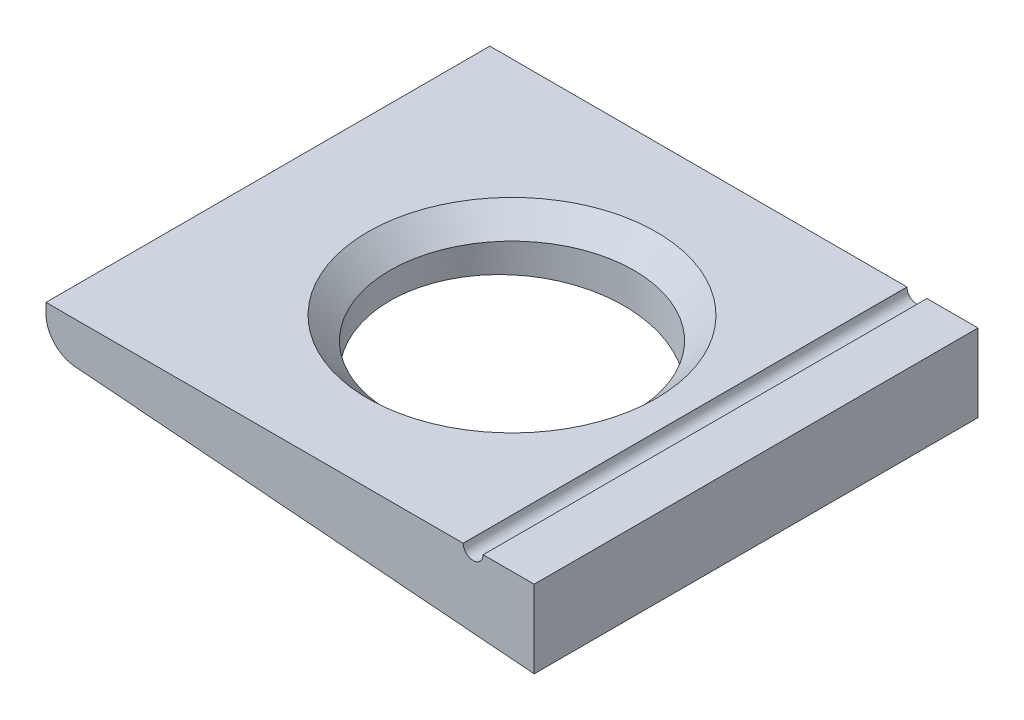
from build123d import *

# Parameters (mm, degrees)
BASE_EXTRUDE_DEPTH = 20
SKETCH2_R          = 11
CUT_EXTRUDE1_DEPTH = 31.545048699
SKETCH3_R          = 0.9
ID_GROOVES_DEPTH   = 47.184412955
CHAMFER1_SIZE      = 2


with BuildPart() as part:
    # Sketch1 → Base-Extrude (new, symmetric)
    with BuildSketch(Plane.XY):
        with BuildLine():
            Line((22, 0), (-22, 0))
            Line((-22, 0), (-22, -0.91388277))
            ThreePointArc((-22, -0.91388277), (-21.256899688, -2.813662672), (-19.422025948, -3.705066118))
            Line((-19.422025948, -3.705066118), (22, -7))
            Line((22, -7), (22, 0))
        make_face()
    extrude(amount=BASE_EXTRUDE_DEPTH, both=True)

    # Sketch2 → Cut-Extrude1 (cut, through all)
    with BuildSketch(Plane(origin=(0, 0, 0), x_dir=(-1, 0, 0), z_dir=(0, 1, 0))):
        Circle(SKETCH2_R)
    extrude(amount=-CUT_EXTRUDE1_DEPTH, mode=Mode.SUBTRACT)

    # Sketch3 → ID-Grooves (cut, through all)
    with BuildSketch(Plane.XY.offset(20)):
        with Locations((16.5, 0)):
            Circle(SKETCH3_R)
    extrude(amount=-ID_GROOVES_DEPTH, mode=Mode.SUBTRACT)

    # Chamfer1
    chamfer1_edges = [part.edges().sort_by_distance(p)[0] for p in [
        (11, 0, 0),
    ]]
    chamfer(chamfer1_edges, length=CHAMFER1_SIZE)


solid = part.part
